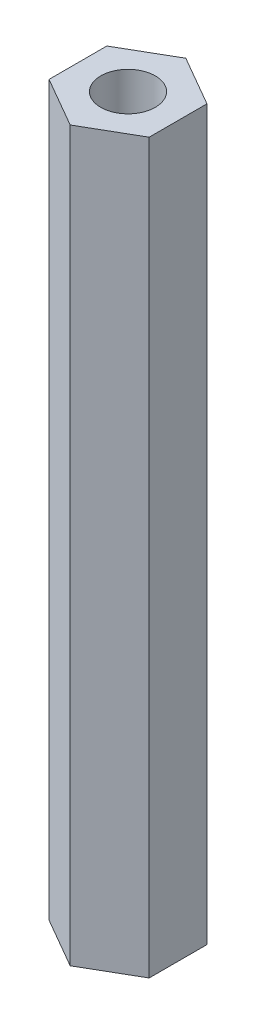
ISO-10303-21;
HEADER;
FILE_DESCRIPTION(('STEP AP214'),'2;1');
FILE_NAME('part.step','',(''),(''),'','','');
FILE_SCHEMA(('AUTOMOTIVE_DESIGN { 1 0 10303 214 1 1 1 1 }'));
ENDSEC;
DATA;
#1=APPLICATION_CONTEXT('core data for automotive mechanical design processes');
#2=APPLICATION_PROTOCOL_DEFINITION('international standard','automotive_design',2000,#1);
#3=PRODUCT_CONTEXT('',#1,'mechanical');
#4=PRODUCT('Part','Part','',(#3));
#5=PRODUCT_RELATED_PRODUCT_CATEGORY('part','',(#4));
#6=PRODUCT_DEFINITION_FORMATION('','',#4);
#7=PRODUCT_DEFINITION_CONTEXT('part definition',#1,'design');
#8=PRODUCT_DEFINITION('design','',#6,#7);
#9=PRODUCT_DEFINITION_SHAPE('','',#8);
#10=(LENGTH_UNIT() NAMED_UNIT(*) SI_UNIT(.MILLI.,.METRE.));
#11=(NAMED_UNIT(*) PLANE_ANGLE_UNIT() SI_UNIT($,.RADIAN.));
#12=(NAMED_UNIT(*) SI_UNIT($,.STERADIAN.) SOLID_ANGLE_UNIT());
#13=UNCERTAINTY_MEASURE_WITH_UNIT(LENGTH_MEASURE(1.E-05),#10,'distance_accuracy_value','');
#14=(GEOMETRIC_REPRESENTATION_CONTEXT(3) GLOBAL_UNCERTAINTY_ASSIGNED_CONTEXT((#13)) GLOBAL_UNIT_ASSIGNED_CONTEXT((#10,
#11,#12)) REPRESENTATION_CONTEXT('',''));
#15=CARTESIAN_POINT('',(0.,0.,0.));
#16=DIRECTION('',(0.,0.,1.));
#17=DIRECTION('',(1.,0.,0.));
#18=AXIS2_PLACEMENT_3D('',#15,#16,#17);
#19=CARTESIAN_POINT('',(0.,40.,0.));
#20=DIRECTION('',(0.,1.,0.));
#21=DIRECTION('',(0.,0.,1.));
#22=AXIS2_PLACEMENT_3D('',#19,#20,#21);
#23=PLANE('',#22);
#24=DIRECTION('',(0.,0.,-1.));
#25=VECTOR('',#24,1.);
#26=CARTESIAN_POINT('',(2.75,40.,1.58771324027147));
#27=LINE('',#26,#25);
#28=CARTESIAN_POINT('',(2.75,40.,1.58771324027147));
#29=VERTEX_POINT('',#28);
#30=CARTESIAN_POINT('',(2.75,40.,-1.58771324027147));
#31=VERTEX_POINT('',#30);
#32=EDGE_CURVE('E146',#29,#31,#27,.T.);
#33=ORIENTED_EDGE('',*,*,#32,.T.);
#34=DIRECTION('',(-0.866025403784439,0.,-0.5));
#35=VECTOR('',#34,1.);
#36=CARTESIAN_POINT('',(2.75,40.,-1.58771324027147));
#37=LINE('',#36,#35);
#38=CARTESIAN_POINT('',(0.,40.,-3.17542648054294));
#39=VERTEX_POINT('',#38);
#40=EDGE_CURVE('E94',#31,#39,#37,.T.);
#41=ORIENTED_EDGE('',*,*,#40,.T.);
#42=DIRECTION('',(-0.866025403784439,0.,0.5));
#43=VECTOR('',#42,1.);
#44=CARTESIAN_POINT('',(0.,40.,-3.17542648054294));
#45=LINE('',#44,#43);
#46=CARTESIAN_POINT('',(-2.75,40.,-1.58771324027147));
#47=VERTEX_POINT('',#46);
#48=EDGE_CURVE('E107',#39,#47,#45,.T.);
#49=ORIENTED_EDGE('',*,*,#48,.T.);
#50=DIRECTION('',(0.,0.,1.));
#51=VECTOR('',#50,1.);
#52=CARTESIAN_POINT('',(-2.75,40.,-1.58771324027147));
#53=LINE('',#52,#51);
#54=CARTESIAN_POINT('',(-2.75,40.,1.58771324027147));
#55=VERTEX_POINT('',#54);
#56=EDGE_CURVE('E101',#47,#55,#53,.T.);
#57=ORIENTED_EDGE('',*,*,#56,.T.);
#58=DIRECTION('',(0.866025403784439,0.,0.5));
#59=VECTOR('',#58,1.);
#60=CARTESIAN_POINT('',(-2.75,40.,1.58771324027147));
#61=LINE('',#60,#59);
#62=CARTESIAN_POINT('',(0.,40.,3.17542648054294));
#63=VERTEX_POINT('',#62);
#64=EDGE_CURVE('E105',#55,#63,#61,.T.);
#65=ORIENTED_EDGE('',*,*,#64,.T.);
#66=DIRECTION('',(0.866025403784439,0.,-0.5));
#67=VECTOR('',#66,1.);
#68=CARTESIAN_POINT('',(0.,40.,3.17542648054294));
#69=LINE('',#68,#67);
#70=EDGE_CURVE('E57',#63,#29,#69,.T.);
#71=ORIENTED_EDGE('',*,*,#70,.T.);
#72=EDGE_LOOP('',(#33,#41,#49,#57,#65,#71));
#73=FACE_BOUND('',#72,.T.);
#74=CARTESIAN_POINT('',(0.,40.,0.));
#75=DIRECTION('',(0.,1.,0.));
#76=DIRECTION('',(0.,0.,1.));
#77=AXIS2_PLACEMENT_3D('',#74,#75,#76);
#78=CIRCLE('',#77,1.5);
#79=CARTESIAN_POINT('',(0.,40.,1.5));
#80=VERTEX_POINT('',#79);
#81=EDGE_CURVE('E134',#80,#80,#78,.T.);
#82=ORIENTED_EDGE('',*,*,#81,.F.);
#83=EDGE_LOOP('',(#82));
#84=FACE_BOUND('',#83,.T.);
#85=ADVANCED_FACE('F39',(#73,#84),#23,.T.);
#86=CARTESIAN_POINT('',(0.,0.,0.));
#87=DIRECTION('',(0.,1.,0.));
#88=DIRECTION('',(0.,0.,1.));
#89=AXIS2_PLACEMENT_3D('',#86,#87,#88);
#90=PLANE('',#89);
#91=DIRECTION('',(0.,0.,-1.));
#92=VECTOR('',#91,1.);
#93=CARTESIAN_POINT('',(2.75,0.,1.58771324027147));
#94=LINE('',#93,#92);
#95=CARTESIAN_POINT('',(2.75,0.,1.58771324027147));
#96=VERTEX_POINT('',#95);
#97=CARTESIAN_POINT('',(2.75,0.,-1.58771324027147));
#98=VERTEX_POINT('',#97);
#99=EDGE_CURVE('E129',#96,#98,#94,.T.);
#100=ORIENTED_EDGE('',*,*,#99,.F.);
#101=DIRECTION('',(0.866025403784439,0.,-0.5));
#102=VECTOR('',#101,1.);
#103=CARTESIAN_POINT('',(0.,0.,3.17542648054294));
#104=LINE('',#103,#102);
#105=CARTESIAN_POINT('',(0.,0.,3.17542648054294));
#106=VERTEX_POINT('',#105);
#107=EDGE_CURVE('E86',#106,#96,#104,.T.);
#108=ORIENTED_EDGE('',*,*,#107,.F.);
#109=DIRECTION('',(0.866025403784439,0.,0.5));
#110=VECTOR('',#109,1.);
#111=CARTESIAN_POINT('',(-2.75,0.,1.58771324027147));
#112=LINE('',#111,#110);
#113=CARTESIAN_POINT('',(-2.75,0.,1.58771324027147));
#114=VERTEX_POINT('',#113);
#115=EDGE_CURVE('E80',#114,#106,#112,.T.);
#116=ORIENTED_EDGE('',*,*,#115,.F.);
#117=DIRECTION('',(0.,0.,1.));
#118=VECTOR('',#117,1.);
#119=CARTESIAN_POINT('',(-2.75,0.,-1.58771324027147));
#120=LINE('',#119,#118);
#121=CARTESIAN_POINT('',(-2.75,0.,-1.58771324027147));
#122=VERTEX_POINT('',#121);
#123=EDGE_CURVE('E116',#122,#114,#120,.T.);
#124=ORIENTED_EDGE('',*,*,#123,.F.);
#125=DIRECTION('',(-0.866025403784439,0.,0.5));
#126=VECTOR('',#125,1.);
#127=CARTESIAN_POINT('',(0.,0.,-3.17542648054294));
#128=LINE('',#127,#126);
#129=CARTESIAN_POINT('',(0.,0.,-3.17542648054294));
#130=VERTEX_POINT('',#129);
#131=EDGE_CURVE('E137',#130,#122,#128,.T.);
#132=ORIENTED_EDGE('',*,*,#131,.F.);
#133=DIRECTION('',(-0.866025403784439,0.,-0.5));
#134=VECTOR('',#133,1.);
#135=CARTESIAN_POINT('',(2.75,0.,-1.58771324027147));
#136=LINE('',#135,#134);
#137=EDGE_CURVE('E133',#98,#130,#136,.T.);
#138=ORIENTED_EDGE('',*,*,#137,.F.);
#139=EDGE_LOOP('',(#100,#108,#116,#124,#132,#138));
#140=FACE_BOUND('',#139,.T.);
#141=CARTESIAN_POINT('',(0.,0.,0.));
#142=DIRECTION('',(0.,1.,0.));
#143=DIRECTION('',(0.,0.,1.));
#144=AXIS2_PLACEMENT_3D('',#141,#142,#143);
#145=CIRCLE('',#144,1.5);
#146=CARTESIAN_POINT('',(0.,0.,1.5));
#147=VERTEX_POINT('',#146);
#148=EDGE_CURVE('E243',#147,#147,#145,.T.);
#149=ORIENTED_EDGE('',*,*,#148,.T.);
#150=EDGE_LOOP('',(#149));
#151=FACE_BOUND('',#150,.T.);
#152=ADVANCED_FACE('F159',(#140,#151),#90,.F.);
#153=CARTESIAN_POINT('',(2.75,40.,1.58771324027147));
#154=DIRECTION('',(-1.,0.,0.));
#155=DIRECTION('',(0.,0.,1.));
#156=AXIS2_PLACEMENT_3D('',#153,#154,#155);
#157=PLANE('',#156);
#158=ORIENTED_EDGE('',*,*,#99,.T.);
#159=DIRECTION('',(0.,-1.,0.));
#160=VECTOR('',#159,1.);
#161=CARTESIAN_POINT('',(2.75,40.,-1.58771324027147));
#162=LINE('',#161,#160);
#163=EDGE_CURVE('E11',#31,#98,#162,.T.);
#164=ORIENTED_EDGE('',*,*,#163,.F.);
#165=ORIENTED_EDGE('',*,*,#32,.F.);
#166=DIRECTION('',(0.,-1.,0.));
#167=VECTOR('',#166,1.);
#168=CARTESIAN_POINT('',(2.75,40.,1.58771324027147));
#169=LINE('',#168,#167);
#170=EDGE_CURVE('E125',#29,#96,#169,.T.);
#171=ORIENTED_EDGE('',*,*,#170,.T.);
#172=EDGE_LOOP('',(#158,#164,#165,#171));
#173=FACE_BOUND('',#172,.T.);
#174=ADVANCED_FACE('F41',(#173),#157,.F.);
#175=CARTESIAN_POINT('',(2.75,40.,-1.58771324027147));
#176=DIRECTION('',(-0.5,0.,0.866025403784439));
#177=DIRECTION('',(0.866025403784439,0.,0.5));
#178=AXIS2_PLACEMENT_3D('',#175,#176,#177);
#179=PLANE('',#178);
#180=ORIENTED_EDGE('',*,*,#137,.T.);
#181=DIRECTION('',(0.,-1.,0.));
#182=VECTOR('',#181,1.);
#183=CARTESIAN_POINT('',(0.,40.,-3.17542648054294));
#184=LINE('',#183,#182);
#185=EDGE_CURVE('E49',#39,#130,#184,.T.);
#186=ORIENTED_EDGE('',*,*,#185,.F.);
#187=ORIENTED_EDGE('',*,*,#40,.F.);
#188=ORIENTED_EDGE('',*,*,#163,.T.);
#189=EDGE_LOOP('',(#180,#186,#187,#188));
#190=FACE_BOUND('',#189,.T.);
#191=ADVANCED_FACE('F184',(#190),#179,.F.);
#192=CARTESIAN_POINT('',(0.,40.,-3.17542648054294));
#193=DIRECTION('',(0.5,0.,0.866025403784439));
#194=DIRECTION('',(0.866025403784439,0.,-0.5));
#195=AXIS2_PLACEMENT_3D('',#192,#193,#194);
#196=PLANE('',#195);
#197=ORIENTED_EDGE('',*,*,#131,.T.);
#198=DIRECTION('',(0.,-1.,0.));
#199=VECTOR('',#198,1.);
#200=CARTESIAN_POINT('',(-2.75,40.,-1.58771324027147));
#201=LINE('',#200,#199);
#202=EDGE_CURVE('E118',#47,#122,#201,.T.);
#203=ORIENTED_EDGE('',*,*,#202,.F.);
#204=ORIENTED_EDGE('',*,*,#48,.F.);
#205=ORIENTED_EDGE('',*,*,#185,.T.);
#206=EDGE_LOOP('',(#197,#203,#204,#205));
#207=FACE_BOUND('',#206,.T.);
#208=ADVANCED_FACE('F156',(#207),#196,.F.);
#209=CARTESIAN_POINT('',(-2.75,40.,-1.58771324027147));
#210=DIRECTION('',(1.,0.,0.));
#211=DIRECTION('',(0.,0.,-1.));
#212=AXIS2_PLACEMENT_3D('',#209,#210,#211);
#213=PLANE('',#212);
#214=ORIENTED_EDGE('',*,*,#123,.T.);
#215=DIRECTION('',(0.,-1.,0.));
#216=VECTOR('',#215,1.);
#217=CARTESIAN_POINT('',(-2.75,40.,1.58771324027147));
#218=LINE('',#217,#216);
#219=EDGE_CURVE('E113',#55,#114,#218,.T.);
#220=ORIENTED_EDGE('',*,*,#219,.F.);
#221=ORIENTED_EDGE('',*,*,#56,.F.);
#222=ORIENTED_EDGE('',*,*,#202,.T.);
#223=EDGE_LOOP('',(#214,#220,#221,#222));
#224=FACE_BOUND('',#223,.T.);
#225=ADVANCED_FACE('F114',(#224),#213,.F.);
#226=CARTESIAN_POINT('',(-2.75,40.,1.58771324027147));
#227=DIRECTION('',(0.5,0.,-0.866025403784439));
#228=DIRECTION('',(-0.866025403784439,0.,-0.5));
#229=AXIS2_PLACEMENT_3D('',#226,#227,#228);
#230=PLANE('',#229);
#231=ORIENTED_EDGE('',*,*,#115,.T.);
#232=DIRECTION('',(0.,-1.,0.));
#233=VECTOR('',#232,1.);
#234=CARTESIAN_POINT('',(0.,40.,3.17542648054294));
#235=LINE('',#234,#233);
#236=EDGE_CURVE('E119',#63,#106,#235,.T.);
#237=ORIENTED_EDGE('',*,*,#236,.F.);
#238=ORIENTED_EDGE('',*,*,#64,.F.);
#239=ORIENTED_EDGE('',*,*,#219,.T.);
#240=EDGE_LOOP('',(#231,#237,#238,#239));
#241=FACE_BOUND('',#240,.T.);
#242=ADVANCED_FACE('F121',(#241),#230,.F.);
#243=CARTESIAN_POINT('',(0.,40.,3.17542648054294));
#244=DIRECTION('',(-0.5,0.,-0.866025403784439));
#245=DIRECTION('',(-0.866025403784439,0.,0.5));
#246=AXIS2_PLACEMENT_3D('',#243,#244,#245);
#247=PLANE('',#246);
#248=ORIENTED_EDGE('',*,*,#107,.T.);
#249=ORIENTED_EDGE('',*,*,#170,.F.);
#250=ORIENTED_EDGE('',*,*,#70,.F.);
#251=ORIENTED_EDGE('',*,*,#236,.T.);
#252=EDGE_LOOP('',(#248,#249,#250,#251));
#253=FACE_BOUND('',#252,.T.);
#254=ADVANCED_FACE('F164',(#253),#247,.F.);
#255=CARTESIAN_POINT('',(0.,40.,0.));
#256=DIRECTION('',(0.,-1.,0.));
#257=DIRECTION('',(0.,0.,-1.));
#258=AXIS2_PLACEMENT_3D('',#255,#256,#257);
#259=CYLINDRICAL_SURFACE('',#258,1.5);
#260=ORIENTED_EDGE('',*,*,#81,.T.);
#261=EDGE_LOOP('',(#260));
#262=FACE_BOUND('',#261,.T.);
#263=ORIENTED_EDGE('',*,*,#148,.F.);
#264=EDGE_LOOP('',(#263));
#265=FACE_BOUND('',#264,.T.);
#266=ADVANCED_FACE('F166',(#262,#265),#259,.F.);
#267=CLOSED_SHELL('',(#85,#152,#174,#191,#208,#225,#242,#254,#266));
#268=MANIFOLD_SOLID_BREP('B2',#267);
#269=ADVANCED_BREP_SHAPE_REPRESENTATION('',(#18,#268),#14);
#270=SHAPE_DEFINITION_REPRESENTATION(#9,#269);
ENDSEC;
END-ISO-10303-21;
